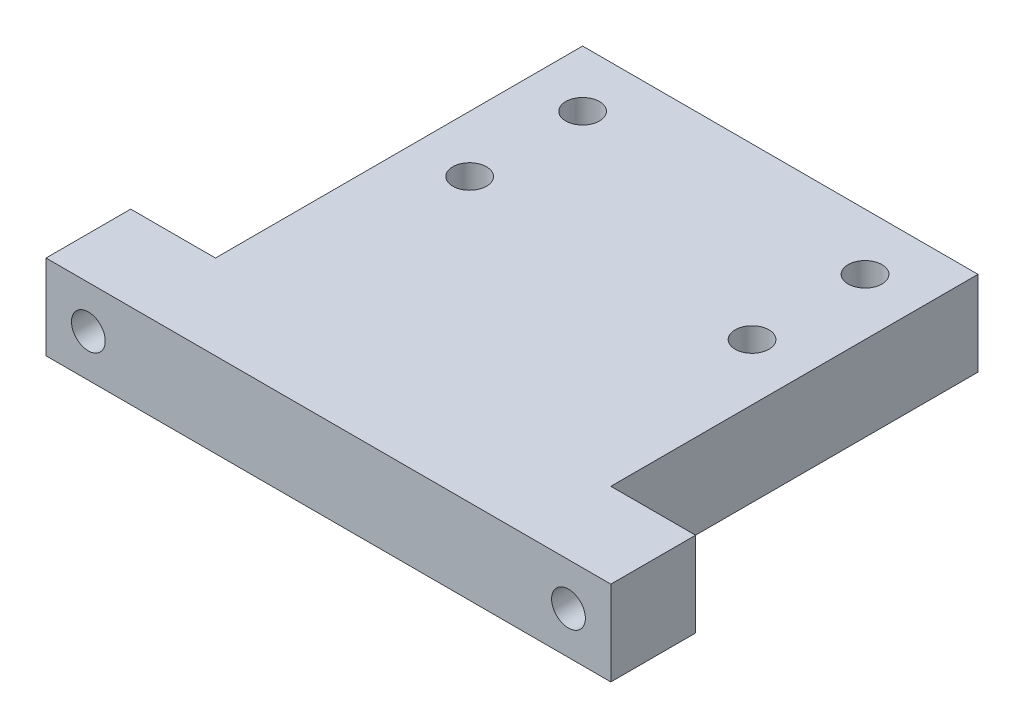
from build123d import *

# Parameters (mm, degrees)
EXTRUDE1_DEPTH        = 4.7625
F_6_CLEARANCE_HOLE1_D = 3.7973
F_6_CLEARANCE_HOLE2_D = 3.7973


with BuildPart() as part:
    # Sketch1 → Extrude1 (new, symmetric)
    with BuildSketch(Plane(origin=(0, 0, 0), x_dir=(1, 0, 0), z_dir=(0, 1, 0))):
        Polygon((-31.75, 0), (31.75, 0), (31.75, 9.525), (22.225, 9.525), (22.225, 50.8), (-22.225, 50.8), (-22.225, 9.525), (-31.75, 9.525), align=None)
    extrude(amount=EXTRUDE1_DEPTH, both=True)

    # 6 Clearance Hole1 (through all)
    with Locations(Plane(origin=(0, 0, -9.525), x_dir=(-1, 0, 0), z_dir=(0, 0, -1))):
        with Locations((-26.9875, 0), (26.9875, 0)):
            Hole(F_6_CLEARANCE_HOLE1_D / 2)

    # 6 Clearance Hole2 (through all)
    with Locations(Plane(origin=(0, 4.7625, 0), x_dir=(-1, 0, 0), z_dir=(0, 1, 0))):
        with Locations((-15.875, -44.45), (15.875, -44.45), (-15.875, -31.75), (15.875, -31.75)):
            Hole(F_6_CLEARANCE_HOLE2_D / 2)


solid = part.part
